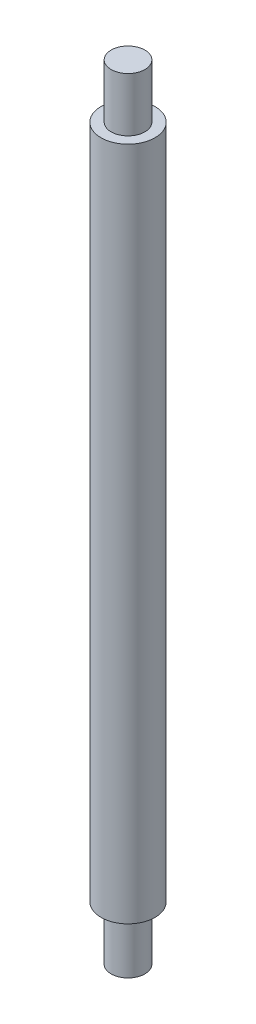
ISO-10303-21;
HEADER;
FILE_DESCRIPTION(('STEP AP214'),'2;1');
FILE_NAME('part.step','',(''),(''),'','','');
FILE_SCHEMA(('AUTOMOTIVE_DESIGN { 1 0 10303 214 1 1 1 1 }'));
ENDSEC;
DATA;
#1=APPLICATION_CONTEXT('core data for automotive mechanical design processes');
#2=APPLICATION_PROTOCOL_DEFINITION('international standard','automotive_design',2000,#1);
#3=PRODUCT_CONTEXT('',#1,'mechanical');
#4=PRODUCT('Part','Part','',(#3));
#5=PRODUCT_RELATED_PRODUCT_CATEGORY('part','',(#4));
#6=PRODUCT_DEFINITION_FORMATION('','',#4);
#7=PRODUCT_DEFINITION_CONTEXT('part definition',#1,'design');
#8=PRODUCT_DEFINITION('design','',#6,#7);
#9=PRODUCT_DEFINITION_SHAPE('','',#8);
#10=(LENGTH_UNIT() NAMED_UNIT(*) SI_UNIT(.MILLI.,.METRE.));
#11=(NAMED_UNIT(*) PLANE_ANGLE_UNIT() SI_UNIT($,.RADIAN.));
#12=(NAMED_UNIT(*) SI_UNIT($,.STERADIAN.) SOLID_ANGLE_UNIT());
#13=UNCERTAINTY_MEASURE_WITH_UNIT(LENGTH_MEASURE(1.E-05),#10,'distance_accuracy_value','');
#14=(GEOMETRIC_REPRESENTATION_CONTEXT(3) GLOBAL_UNCERTAINTY_ASSIGNED_CONTEXT((#13)) GLOBAL_UNIT_ASSIGNED_CONTEXT((#10,
#11,#12)) REPRESENTATION_CONTEXT('',''));
#15=CARTESIAN_POINT('',(0.,0.,0.));
#16=DIRECTION('',(0.,0.,1.));
#17=DIRECTION('',(1.,0.,0.));
#18=AXIS2_PLACEMENT_3D('',#15,#16,#17);
#19=CARTESIAN_POINT('',(0.,58.,0.));
#20=DIRECTION('',(0.,1.,0.));
#21=DIRECTION('',(0.,0.,1.));
#22=AXIS2_PLACEMENT_3D('',#19,#20,#21);
#23=PLANE('',#22);
#24=CARTESIAN_POINT('',(0.,58.,0.));
#25=DIRECTION('',(0.,-1.,0.));
#26=DIRECTION('',(0.,0.,-1.));
#27=AXIS2_PLACEMENT_3D('',#24,#25,#26);
#28=CIRCLE('',#27,2.49999999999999);
#29=CARTESIAN_POINT('',(0.,58.,-2.49999999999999));
#30=VERTEX_POINT('',#29);
#31=EDGE_CURVE('E10',#30,#30,#28,.T.);
#32=ORIENTED_EDGE('',*,*,#31,.F.);
#33=EDGE_LOOP('',(#32));
#34=FACE_BOUND('',#33,.T.);
#35=ADVANCED_FACE('F35',(#34),#23,.T.);
#36=CARTESIAN_POINT('',(0.,-58.,0.));
#37=DIRECTION('',(0.,-1.,0.));
#38=DIRECTION('',(0.,0.,-1.));
#39=AXIS2_PLACEMENT_3D('',#36,#37,#38);
#40=CYLINDRICAL_SURFACE('',#39,2.49999999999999);
#41=ORIENTED_EDGE('',*,*,#31,.T.);
#42=EDGE_LOOP('',(#41));
#43=FACE_BOUND('',#42,.T.);
#44=CARTESIAN_POINT('',(0.,50.,0.));
#45=DIRECTION('',(0.,-1.,0.));
#46=DIRECTION('',(0.,0.,-1.));
#47=AXIS2_PLACEMENT_3D('',#44,#45,#46);
#48=CIRCLE('',#47,2.49999999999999);
#49=CARTESIAN_POINT('',(0.,50.,-2.49999999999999));
#50=VERTEX_POINT('',#49);
#51=EDGE_CURVE('E41',#50,#50,#48,.T.);
#52=ORIENTED_EDGE('',*,*,#51,.F.);
#53=EDGE_LOOP('',(#52));
#54=FACE_BOUND('',#53,.T.);
#55=ADVANCED_FACE('F77',(#43,#54),#40,.T.);
#56=CARTESIAN_POINT('',(2.49999999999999,50.,0.));
#57=DIRECTION('',(0.,1.,0.));
#58=DIRECTION('',(0.,0.,1.));
#59=AXIS2_PLACEMENT_3D('',#56,#57,#58);
#60=PLANE('',#59);
#61=ORIENTED_EDGE('',*,*,#51,.T.);
#62=EDGE_LOOP('',(#61));
#63=FACE_BOUND('',#62,.T.);
#64=CARTESIAN_POINT('',(0.,50.,0.));
#65=DIRECTION('',(0.,-1.,0.));
#66=DIRECTION('',(0.,0.,-1.));
#67=AXIS2_PLACEMENT_3D('',#64,#65,#66);
#68=CIRCLE('',#67,4.);
#69=CARTESIAN_POINT('',(0.,50.,-4.));
#70=VERTEX_POINT('',#69);
#71=EDGE_CURVE('E45',#70,#70,#68,.T.);
#72=ORIENTED_EDGE('',*,*,#71,.F.);
#73=EDGE_LOOP('',(#72));
#74=FACE_BOUND('',#73,.T.);
#75=ADVANCED_FACE('F82',(#63,#74),#60,.T.);
#76=CARTESIAN_POINT('',(0.,-58.,0.));
#77=DIRECTION('',(0.,-1.,0.));
#78=DIRECTION('',(0.,0.,-1.));
#79=AXIS2_PLACEMENT_3D('',#76,#77,#78);
#80=CYLINDRICAL_SURFACE('',#79,4.);
#81=ORIENTED_EDGE('',*,*,#71,.T.);
#82=EDGE_LOOP('',(#81));
#83=FACE_BOUND('',#82,.T.);
#84=CARTESIAN_POINT('',(0.,-50.,0.));
#85=DIRECTION('',(0.,-1.,0.));
#86=DIRECTION('',(0.,0.,-1.));
#87=AXIS2_PLACEMENT_3D('',#84,#85,#86);
#88=CIRCLE('',#87,4.);
#89=CARTESIAN_POINT('',(0.,-50.,-4.));
#90=VERTEX_POINT('',#89);
#91=EDGE_CURVE('E49',#90,#90,#88,.T.);
#92=ORIENTED_EDGE('',*,*,#91,.F.);
#93=EDGE_LOOP('',(#92));
#94=FACE_BOUND('',#93,.T.);
#95=ADVANCED_FACE('F73',(#83,#94),#80,.T.);
#96=CARTESIAN_POINT('',(4.,-50.,0.));
#97=DIRECTION('',(0.,-1.,0.));
#98=DIRECTION('',(0.,0.,-1.));
#99=AXIS2_PLACEMENT_3D('',#96,#97,#98);
#100=PLANE('',#99);
#101=ORIENTED_EDGE('',*,*,#91,.T.);
#102=EDGE_LOOP('',(#101));
#103=FACE_BOUND('',#102,.T.);
#104=CARTESIAN_POINT('',(0.,-50.,0.));
#105=DIRECTION('',(0.,-1.,0.));
#106=DIRECTION('',(0.,0.,-1.));
#107=AXIS2_PLACEMENT_3D('',#104,#105,#106);
#108=CIRCLE('',#107,2.49999999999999);
#109=CARTESIAN_POINT('',(0.,-50.,-2.49999999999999));
#110=VERTEX_POINT('',#109);
#111=EDGE_CURVE('E54',#110,#110,#108,.T.);
#112=ORIENTED_EDGE('',*,*,#111,.F.);
#113=EDGE_LOOP('',(#112));
#114=FACE_BOUND('',#113,.T.);
#115=ADVANCED_FACE('F65',(#103,#114),#100,.T.);
#116=CARTESIAN_POINT('',(0.,-58.,0.));
#117=DIRECTION('',(0.,-1.,0.));
#118=DIRECTION('',(0.,0.,-1.));
#119=AXIS2_PLACEMENT_3D('',#116,#117,#118);
#120=CYLINDRICAL_SURFACE('',#119,2.49999999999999);
#121=ORIENTED_EDGE('',*,*,#111,.T.);
#122=EDGE_LOOP('',(#121));
#123=FACE_BOUND('',#122,.T.);
#124=CARTESIAN_POINT('',(0.,-58.,0.));
#125=DIRECTION('',(0.,-1.,0.));
#126=DIRECTION('',(0.,0.,-1.));
#127=AXIS2_PLACEMENT_3D('',#124,#125,#126);
#128=CIRCLE('',#127,2.5);
#129=CARTESIAN_POINT('',(0.,-58.,-2.5));
#130=VERTEX_POINT('',#129);
#131=EDGE_CURVE('E57',#130,#130,#128,.T.);
#132=ORIENTED_EDGE('',*,*,#131,.F.);
#133=EDGE_LOOP('',(#132));
#134=FACE_BOUND('',#133,.T.);
#135=ADVANCED_FACE('F63',(#123,#134),#120,.T.);
#136=CARTESIAN_POINT('',(2.5,-58.,0.));
#137=DIRECTION('',(0.,-1.,0.));
#138=DIRECTION('',(0.,0.,-1.));
#139=AXIS2_PLACEMENT_3D('',#136,#137,#138);
#140=PLANE('',#139);
#141=ORIENTED_EDGE('',*,*,#131,.T.);
#142=EDGE_LOOP('',(#141));
#143=FACE_BOUND('',#142,.T.);
#144=ADVANCED_FACE('F61',(#143),#140,.T.);
#145=CLOSED_SHELL('',(#35,#55,#75,#95,#115,#135,#144));
#146=MANIFOLD_SOLID_BREP('B2',#145);
#147=ADVANCED_BREP_SHAPE_REPRESENTATION('',(#18,#146),#14);
#148=SHAPE_DEFINITION_REPRESENTATION(#9,#147);
ENDSEC;
END-ISO-10303-21;
